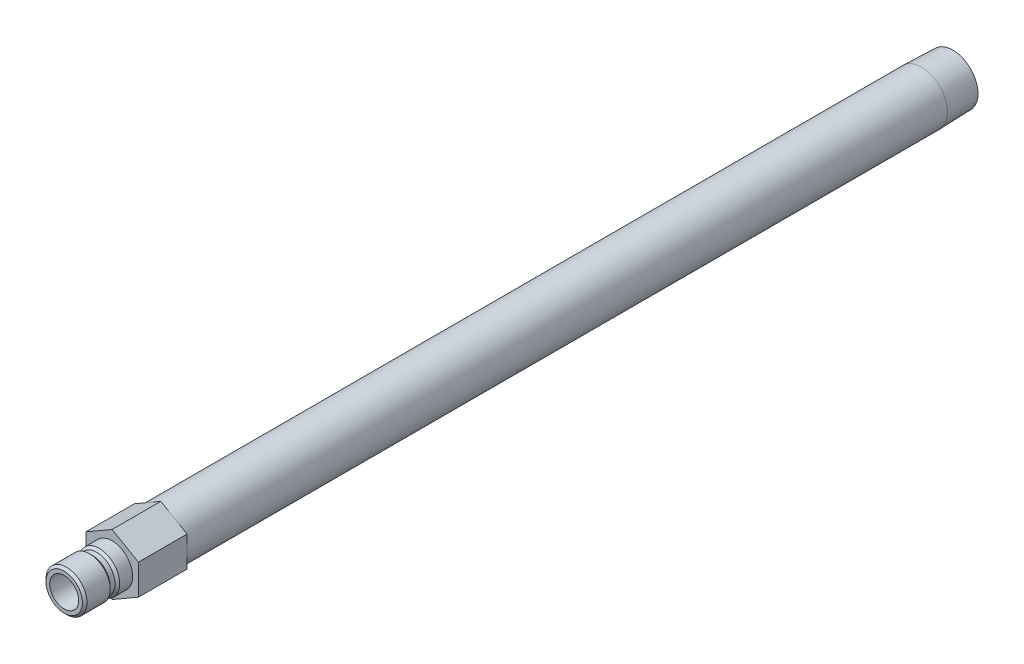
from build123d import *

# Parameters (mm, degrees)
SKETCH2_R           = 4.7625
BOSS_EXTRUDE1_DEPTH = 16.002


with BuildPart() as part:
    # Sketch1 → Revolve1 (revolve)
    with BuildSketch(Plane(origin=(0, 0, 0), x_dir=(0, 0, -1), z_dir=(1, 0, 0))):
        Polygon((-15.748, 4.7625), (-15.748, 5.9817), (-14.986, 6.7437), (-7.366, 6.7437), (-6.604, 5.9817), (-5.0165, 5.9817), (-4.2545, 6.7437), (0, 6.7437), (0, 8.5725), (266.0142, 8.5725), (276.352, 8.249445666), (276.352, 6.2611), (16.002, 6.2611), (16.002, 4.7625), align=None)
    revolve(axis=Axis((0, 0, 0), (0, 0, 1)))

    # Sketch2 → Boss-Extrude1 (add)
    with BuildSketch(Plane.XY):
        Polygon((-8.636, 4.985996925), (-8.636, -4.985996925), (0, -9.971993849), (8.636, -4.985996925), (8.636, 4.985996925), (0, 9.971993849), align=None)
        with Locations(Location((0, 0, 0), (0, 0, 90))):
            Circle(SKETCH2_R, mode=Mode.SUBTRACT)
    extrude(amount=-BOSS_EXTRUDE1_DEPTH)


solid = part.part
